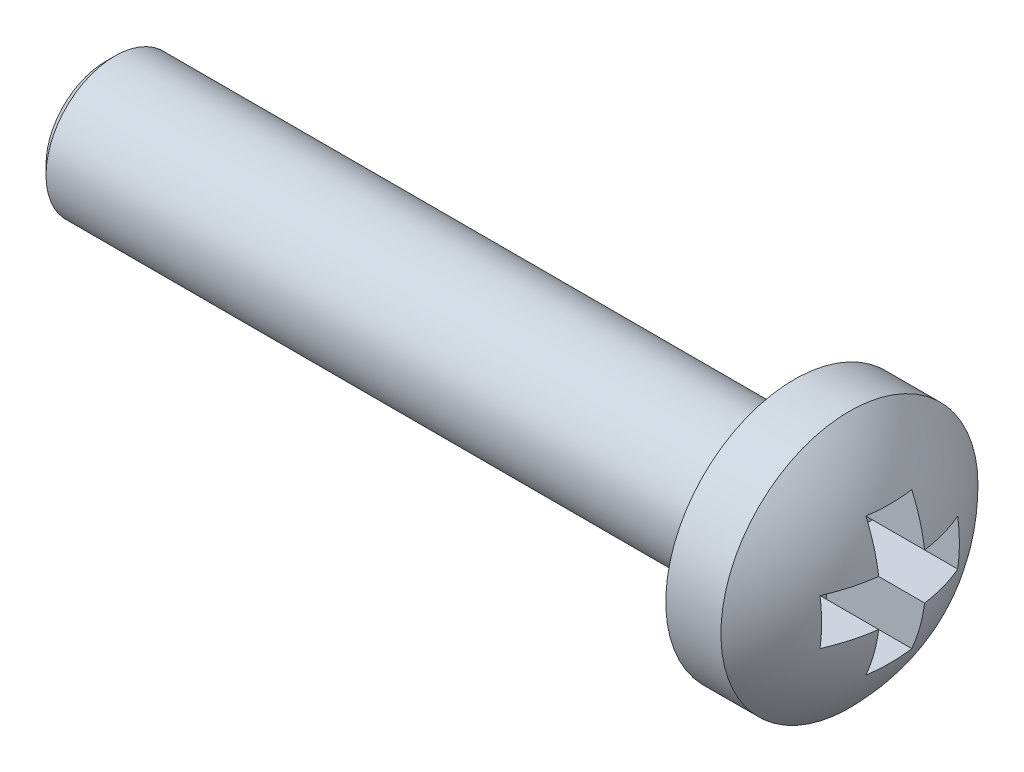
from build123d import *

# Parameters (mm, degrees)
CHANFREIN1_SIZE         = 0.2
ENL_V_START             = -2.4
ENL_V_MAT_EXTRU_1_DEPTH = 2.2


with BuildPart() as part:
    # Esquisse1 → R_volution1 (revolve)
    with BuildSketch(Plane.XY, mode=Mode.PRIVATE) as r_volution1_sk:
        with BuildLine():
            Line((0, 1.5), (0, 2.8))
            Line((0, 2.8), (1.2, 2.8))
            add(Edge.make_bspline(
                [(1.2, 2.8), (2.4, 1.571691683), (2.4, 0)],
                knots=[0, 0, 0, 1, 1, 1], degree=2))
            Line((2.4, 0), (-15, 0))
            Line((-15, 0), (-15, 1.5))
            Line((-15, 1.5), (0, 1.5))
        make_face()
    revolve(r_volution1_sk.sketch.rotate(Axis((11.061826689, 0, 0), (-1, 0, 0)), 90), axis=Axis((11.061826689, 0, 0), (-1, 0, 0)))

    # Chanfrein1
    chanfrein1_edges = [part.edges().sort_by_distance(p)[0] for p in [
        (-15, 0, 1.5),
    ]]
    chamfer(chanfrein1_edges, length=CHANFREIN1_SIZE)

    # Esquisse2 → Enl_v. mat.-Extru.1 (cut)
    with BuildSketch(Plane.ZY.offset(ENL_V_START)):
        Polygon((-0.5, 0.5), (-1.5, 0.5), (-1.5, -0.5), (-0.5, -0.5), (-0.5, -1.5), (0.5, -1.5), (0.5, -0.5), (1.5, -0.5), (1.5, 0.5), (0.5, 0.5), (0.5, 1.5), (-0.5, 1.5), align=None)
    extrude(amount=ENL_V_MAT_EXTRU_1_DEPTH, mode=Mode.SUBTRACT)


solid = part.part
